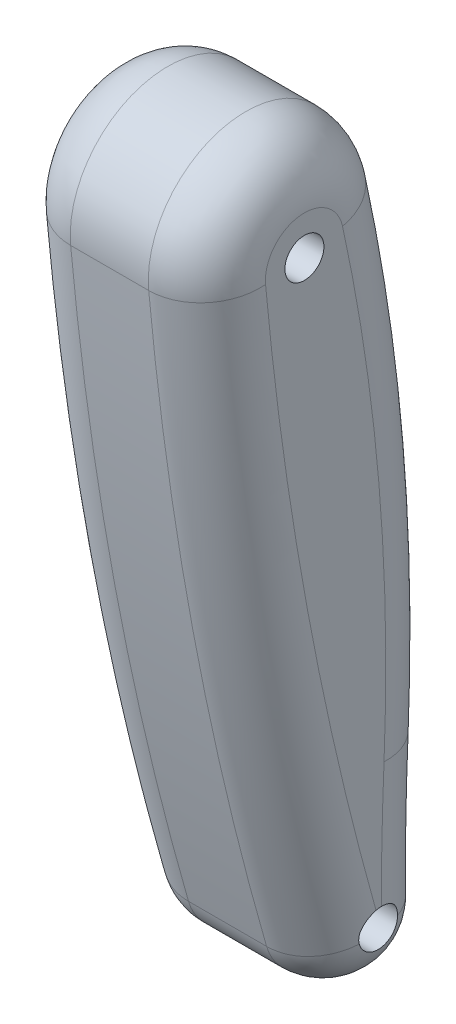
from build123d import *

# Parameters (mm, degrees)
BASE_EXTRUDE_DEPTH = 63.5
FILLET1_R          = 38.1
SKETCH8_R          = 12.7
CUT_EXTRUDE1_DEPTH = 1208.02037805


with BuildPart() as part:
    # Sketch7 → Base-Extrude (new, symmetric)
    with BuildSketch(Plane(origin=(0, 0, 0), x_dir=(0, 0, -1), z_dir=(1, 0, 0))):
        with BuildLine():
            ThreePointArc((37.885471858, -742.213802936), (-33.838948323, -692.9538134), (-87.396251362, -761.528986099))
            ThreePointArc((-87.396251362, -761.528986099), (-58.651901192, -967.339401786), (-10.701792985, -1169.539678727))
            ThreePointArc((-10.701792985, -1169.539678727), (31.347433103, -1196.725838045), (64.014969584, -1158.777758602))
            ThreePointArc((64.014969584, -1158.777758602), (64.297743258, -1113.02154154), (65.715717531, -1067.286426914))
            ThreePointArc((65.715717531, -1067.286426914), (62.282866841, -903.852702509), (37.885471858, -742.213802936))
        make_face()
    extrude(amount=BASE_EXTRUDE_DEPTH, both=True)

    # Fillet1
    fillet1_edges = [part.edges().sort_by_distance(p)[0] for p in [
        (-63.5, -903.852702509, -62.282866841),
        (63.5, -903.852702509, -62.282866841),
        (-63.5, -1113.02154154, -64.297743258),
        (63.5, -1113.02154154, -64.297743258),
        (-63.5, -1196.725838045, -31.347433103),
        (63.5, -1196.725838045, -31.347433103),
        (-63.5, -967.339401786, 58.651901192),
        (63.5, -967.339401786, 58.651901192),
        (63.5, -692.9538134, 33.838948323),
        (-63.5, -692.9538134, 33.838948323),
    ]]
    fillet(fillet1_edges, radius=FILLET1_R)

    # Sketch8 → Cut-Extrude1 (cut, through all)
    with BuildSketch(Plane.ZY.offset(63.5)):
        with Locations((24.163218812, -755.712320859)):
            Circle(SKETCH8_R)
        with Locations(Location((-25.915708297, -1159.015012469, 0), (0, 0, 343.964197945))):
            Circle(SKETCH8_R)
    extrude(amount=-CUT_EXTRUDE1_DEPTH, mode=Mode.SUBTRACT)


solid = part.part
